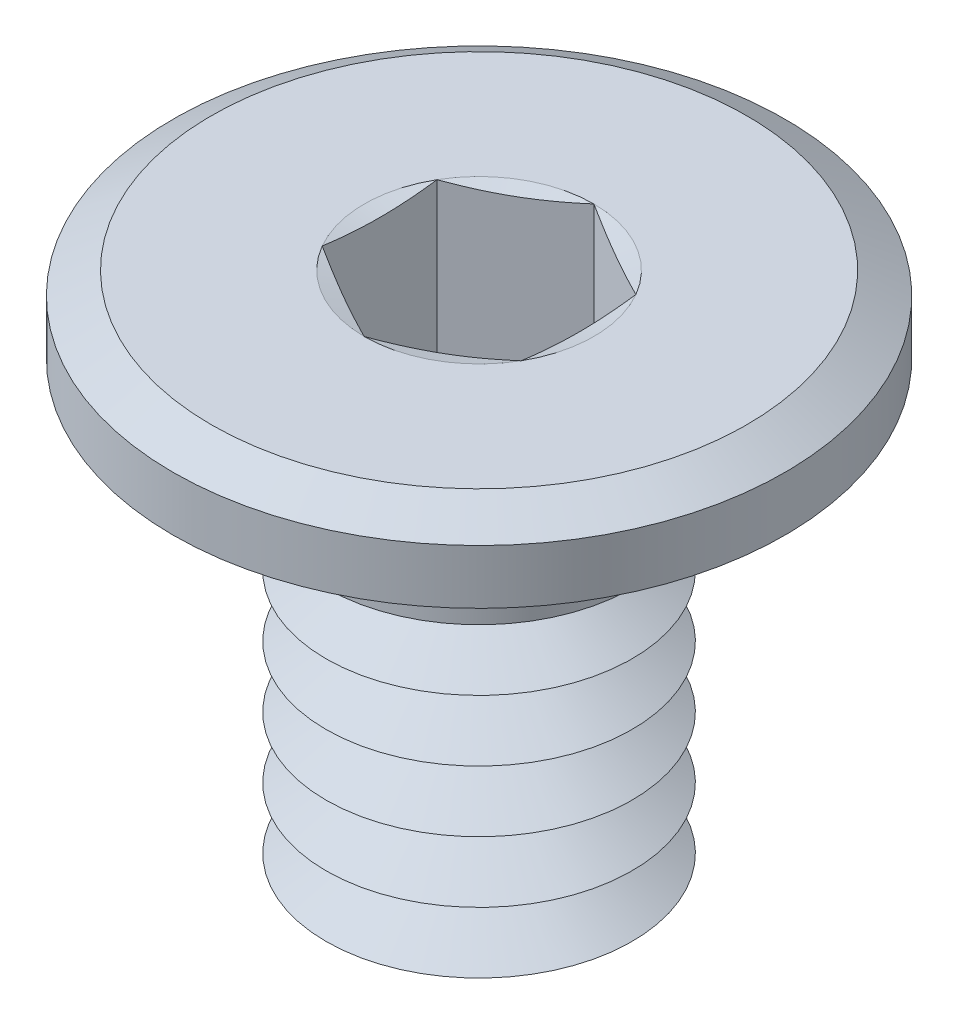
ISO-10303-21;
HEADER;
FILE_DESCRIPTION(('STEP AP214'),'2;1');
FILE_NAME('part.step','',(''),(''),'','','');
FILE_SCHEMA(('AUTOMOTIVE_DESIGN { 1 0 10303 214 1 1 1 1 }'));
ENDSEC;
DATA;
#1=APPLICATION_CONTEXT('core data for automotive mechanical design processes');
#2=APPLICATION_PROTOCOL_DEFINITION('international standard','automotive_design',2000,#1);
#3=PRODUCT_CONTEXT('',#1,'mechanical');
#4=PRODUCT('Part','Part','',(#3));
#5=PRODUCT_RELATED_PRODUCT_CATEGORY('part','',(#4));
#6=PRODUCT_DEFINITION_FORMATION('','',#4);
#7=PRODUCT_DEFINITION_CONTEXT('part definition',#1,'design');
#8=PRODUCT_DEFINITION('design','',#6,#7);
#9=PRODUCT_DEFINITION_SHAPE('','',#8);
#10=(LENGTH_UNIT() NAMED_UNIT(*) SI_UNIT(.MILLI.,.METRE.));
#11=(NAMED_UNIT(*) PLANE_ANGLE_UNIT() SI_UNIT($,.RADIAN.));
#12=(NAMED_UNIT(*) SI_UNIT($,.STERADIAN.) SOLID_ANGLE_UNIT());
#13=UNCERTAINTY_MEASURE_WITH_UNIT(LENGTH_MEASURE(1.E-05),#10,'distance_accuracy_value','');
#14=(GEOMETRIC_REPRESENTATION_CONTEXT(3) GLOBAL_UNCERTAINTY_ASSIGNED_CONTEXT((#13)) GLOBAL_UNIT_ASSIGNED_CONTEXT((#10,
#11,#12)) REPRESENTATION_CONTEXT('',''));
#15=CARTESIAN_POINT('',(0.,0.,0.));
#16=DIRECTION('',(0.,0.,1.));
#17=DIRECTION('',(1.,0.,0.));
#18=AXIS2_PLACEMENT_3D('',#15,#16,#17);
#19=CARTESIAN_POINT('',(0.,-2.9,0.));
#20=DIRECTION('',(0.,-1.,0.));
#21=DIRECTION('',(0.,0.,-1.));
#22=AXIS2_PLACEMENT_3D('',#19,#20,#21);
#23=CONICAL_SURFACE('',#22,1.,1.0471975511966);
#24=CARTESIAN_POINT('',(0.,-2.7,0.));
#25=DIRECTION('',(0.,1.,0.));
#26=DIRECTION('',(0.,0.,1.));
#27=AXIS2_PLACEMENT_3D('',#24,#25,#26);
#28=CIRCLE('',#27,0.653589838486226);
#29=CARTESIAN_POINT('',(0.,-2.7,0.653589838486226));
#30=VERTEX_POINT('',#29);
#31=EDGE_CURVE('E403',#30,#30,#28,.T.);
#32=ORIENTED_EDGE('',*,*,#31,.F.);
#33=EDGE_LOOP('',(#32));
#34=FACE_BOUND('',#33,.T.);
#35=CARTESIAN_POINT('',(0.,-2.9,0.));
#36=DIRECTION('',(0.,1.,0.));
#37=DIRECTION('',(0.,0.,1.));
#38=AXIS2_PLACEMENT_3D('',#35,#36,#37);
#39=CIRCLE('',#38,1.);
#40=CARTESIAN_POINT('',(0.,-2.9,1.));
#41=VERTEX_POINT('',#40);
#42=EDGE_CURVE('E406',#41,#41,#39,.T.);
#43=ORIENTED_EDGE('',*,*,#42,.T.);
#44=EDGE_LOOP('',(#43));
#45=FACE_BOUND('',#44,.T.);
#46=ADVANCED_FACE('F39',(#34,#45),#23,.T.);
#47=CARTESIAN_POINT('',(0.,-2.7,0.));
#48=DIRECTION('',(0.,1.,0.));
#49=DIRECTION('',(0.,0.,1.));
#50=AXIS2_PLACEMENT_3D('',#47,#48,#49);
#51=CONICAL_SURFACE('',#50,0.653589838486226,1.0471975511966);
#52=CARTESIAN_POINT('',(0.,-2.5,0.));
#53=DIRECTION('',(0.,1.,0.));
#54=DIRECTION('',(0.,0.,1.));
#55=AXIS2_PLACEMENT_3D('',#52,#53,#54);
#56=CIRCLE('',#55,1.);
#57=CARTESIAN_POINT('',(0.,-2.5,1.));
#58=VERTEX_POINT('',#57);
#59=EDGE_CURVE('E399',#58,#58,#56,.T.);
#60=ORIENTED_EDGE('',*,*,#59,.F.);
#61=EDGE_LOOP('',(#60));
#62=FACE_BOUND('',#61,.T.);
#63=ORIENTED_EDGE('',*,*,#31,.T.);
#64=EDGE_LOOP('',(#63));
#65=FACE_BOUND('',#64,.T.);
#66=ADVANCED_FACE('F233',(#62,#65),#51,.T.);
#67=CARTESIAN_POINT('',(0.,-3.5,0.));
#68=DIRECTION('',(0.,-1.,0.));
#69=DIRECTION('',(0.,0.,-1.));
#70=AXIS2_PLACEMENT_3D('',#67,#68,#69);
#71=PLANE('',#70);
#72=CARTESIAN_POINT('',(0.,-3.5,0.));
#73=DIRECTION('',(0.,1.,0.));
#74=DIRECTION('',(0.,0.,1.));
#75=AXIS2_PLACEMENT_3D('',#72,#73,#74);
#76=CIRCLE('',#75,0.653589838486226);
#77=CARTESIAN_POINT('',(0.,-3.5,0.653589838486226));
#78=VERTEX_POINT('',#77);
#79=EDGE_CURVE('E299',#78,#78,#76,.T.);
#80=ORIENTED_EDGE('',*,*,#79,.F.);
#81=EDGE_LOOP('',(#80));
#82=FACE_BOUND('',#81,.T.);
#83=ADVANCED_FACE('F239',(#82),#71,.T.);
#84=CARTESIAN_POINT('',(0.,-3.5,0.));
#85=DIRECTION('',(0.,1.,0.));
#86=DIRECTION('',(0.,0.,1.));
#87=AXIS2_PLACEMENT_3D('',#84,#85,#86);
#88=CONICAL_SURFACE('',#87,0.653589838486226,1.0471975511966);
#89=CARTESIAN_POINT('',(0.,-3.3,0.));
#90=DIRECTION('',(0.,1.,0.));
#91=DIRECTION('',(0.,0.,1.));
#92=AXIS2_PLACEMENT_3D('',#89,#90,#91);
#93=CIRCLE('',#92,1.);
#94=CARTESIAN_POINT('',(0.,-3.3,1.));
#95=VERTEX_POINT('',#94);
#96=EDGE_CURVE('E414',#95,#95,#93,.T.);
#97=ORIENTED_EDGE('',*,*,#96,.F.);
#98=EDGE_LOOP('',(#97));
#99=FACE_BOUND('',#98,.T.);
#100=ORIENTED_EDGE('',*,*,#79,.T.);
#101=EDGE_LOOP('',(#100));
#102=FACE_BOUND('',#101,.T.);
#103=ADVANCED_FACE('F254',(#99,#102),#88,.T.);
#104=CARTESIAN_POINT('',(0.,-3.3,0.));
#105=DIRECTION('',(0.,-1.,0.));
#106=DIRECTION('',(0.,0.,-1.));
#107=AXIS2_PLACEMENT_3D('',#104,#105,#106);
#108=CONICAL_SURFACE('',#107,1.,1.0471975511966);
#109=CARTESIAN_POINT('',(0.,-3.1,0.));
#110=DIRECTION('',(0.,1.,0.));
#111=DIRECTION('',(0.,0.,1.));
#112=AXIS2_PLACEMENT_3D('',#109,#110,#111);
#113=CIRCLE('',#112,0.653589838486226);
#114=CARTESIAN_POINT('',(0.,-3.1,0.653589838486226));
#115=VERTEX_POINT('',#114);
#116=EDGE_CURVE('E410',#115,#115,#113,.T.);
#117=ORIENTED_EDGE('',*,*,#116,.F.);
#118=EDGE_LOOP('',(#117));
#119=FACE_BOUND('',#118,.T.);
#120=ORIENTED_EDGE('',*,*,#96,.T.);
#121=EDGE_LOOP('',(#120));
#122=FACE_BOUND('',#121,.T.);
#123=ADVANCED_FACE('F250',(#119,#122),#108,.T.);
#124=CARTESIAN_POINT('',(0.,-3.1,0.));
#125=DIRECTION('',(0.,1.,0.));
#126=DIRECTION('',(0.,0.,1.));
#127=AXIS2_PLACEMENT_3D('',#124,#125,#126);
#128=CONICAL_SURFACE('',#127,0.653589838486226,1.0471975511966);
#129=ORIENTED_EDGE('',*,*,#42,.F.);
#130=EDGE_LOOP('',(#129));
#131=FACE_BOUND('',#130,.T.);
#132=ORIENTED_EDGE('',*,*,#116,.T.);
#133=EDGE_LOOP('',(#132));
#134=FACE_BOUND('',#133,.T.);
#135=ADVANCED_FACE('F246',(#131,#134),#128,.T.);
#136=CARTESIAN_POINT('',(0.,-2.5,0.));
#137=DIRECTION('',(0.,-1.,0.));
#138=DIRECTION('',(0.,0.,-1.));
#139=AXIS2_PLACEMENT_3D('',#136,#137,#138);
#140=CONICAL_SURFACE('',#139,1.,1.0471975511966);
#141=CARTESIAN_POINT('',(0.,-2.3,0.));
#142=DIRECTION('',(0.,1.,0.));
#143=DIRECTION('',(0.,0.,1.));
#144=AXIS2_PLACEMENT_3D('',#141,#142,#143);
#145=CIRCLE('',#144,0.653589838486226);
#146=CARTESIAN_POINT('',(0.,-2.3,0.653589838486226));
#147=VERTEX_POINT('',#146);
#148=EDGE_CURVE('E396',#147,#147,#145,.T.);
#149=ORIENTED_EDGE('',*,*,#148,.F.);
#150=EDGE_LOOP('',(#149));
#151=FACE_BOUND('',#150,.T.);
#152=ORIENTED_EDGE('',*,*,#59,.T.);
#153=EDGE_LOOP('',(#152));
#154=FACE_BOUND('',#153,.T.);
#155=ADVANCED_FACE('F249',(#151,#154),#140,.T.);
#156=CARTESIAN_POINT('',(0.,-2.3,0.));
#157=DIRECTION('',(0.,1.,0.));
#158=DIRECTION('',(0.,0.,1.));
#159=AXIS2_PLACEMENT_3D('',#156,#157,#158);
#160=CONICAL_SURFACE('',#159,0.653589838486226,1.0471975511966);
#161=CARTESIAN_POINT('',(0.,-2.1,0.));
#162=DIRECTION('',(0.,1.,0.));
#163=DIRECTION('',(0.,0.,1.));
#164=AXIS2_PLACEMENT_3D('',#161,#162,#163);
#165=CIRCLE('',#164,1.);
#166=CARTESIAN_POINT('',(0.,-2.1,1.));
#167=VERTEX_POINT('',#166);
#168=EDGE_CURVE('E393',#167,#167,#165,.T.);
#169=ORIENTED_EDGE('',*,*,#168,.F.);
#170=EDGE_LOOP('',(#169));
#171=FACE_BOUND('',#170,.T.);
#172=ORIENTED_EDGE('',*,*,#148,.T.);
#173=EDGE_LOOP('',(#172));
#174=FACE_BOUND('',#173,.T.);
#175=ADVANCED_FACE('F490',(#171,#174),#160,.T.);
#176=CARTESIAN_POINT('',(0.,-2.1,0.));
#177=DIRECTION('',(0.,-1.,0.));
#178=DIRECTION('',(0.,0.,-1.));
#179=AXIS2_PLACEMENT_3D('',#176,#177,#178);
#180=CONICAL_SURFACE('',#179,1.,1.0471975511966);
#181=CARTESIAN_POINT('',(0.,-1.9,0.));
#182=DIRECTION('',(0.,1.,0.));
#183=DIRECTION('',(0.,0.,1.));
#184=AXIS2_PLACEMENT_3D('',#181,#182,#183);
#185=CIRCLE('',#184,0.653589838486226);
#186=CARTESIAN_POINT('',(0.,-1.9,0.653589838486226));
#187=VERTEX_POINT('',#186);
#188=EDGE_CURVE('E389',#187,#187,#185,.T.);
#189=ORIENTED_EDGE('',*,*,#188,.F.);
#190=EDGE_LOOP('',(#189));
#191=FACE_BOUND('',#190,.T.);
#192=ORIENTED_EDGE('',*,*,#168,.T.);
#193=EDGE_LOOP('',(#192));
#194=FACE_BOUND('',#193,.T.);
#195=ADVANCED_FACE('F486',(#191,#194),#180,.T.);
#196=CARTESIAN_POINT('',(0.,-1.9,0.));
#197=DIRECTION('',(0.,1.,0.));
#198=DIRECTION('',(0.,0.,1.));
#199=AXIS2_PLACEMENT_3D('',#196,#197,#198);
#200=CONICAL_SURFACE('',#199,0.653589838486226,1.0471975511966);
#201=CARTESIAN_POINT('',(0.,-1.7,0.));
#202=DIRECTION('',(0.,1.,0.));
#203=DIRECTION('',(0.,0.,1.));
#204=AXIS2_PLACEMENT_3D('',#201,#202,#203);
#205=CIRCLE('',#204,1.);
#206=CARTESIAN_POINT('',(0.,-1.7,1.));
#207=VERTEX_POINT('',#206);
#208=EDGE_CURVE('E385',#207,#207,#205,.T.);
#209=ORIENTED_EDGE('',*,*,#208,.F.);
#210=EDGE_LOOP('',(#209));
#211=FACE_BOUND('',#210,.T.);
#212=ORIENTED_EDGE('',*,*,#188,.T.);
#213=EDGE_LOOP('',(#212));
#214=FACE_BOUND('',#213,.T.);
#215=ADVANCED_FACE('F482',(#211,#214),#200,.T.);
#216=CARTESIAN_POINT('',(0.,-1.7,0.));
#217=DIRECTION('',(0.,-1.,0.));
#218=DIRECTION('',(0.,0.,-1.));
#219=AXIS2_PLACEMENT_3D('',#216,#217,#218);
#220=CONICAL_SURFACE('',#219,1.,1.0471975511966);
#221=CARTESIAN_POINT('',(0.,-1.5,0.));
#222=DIRECTION('',(0.,1.,0.));
#223=DIRECTION('',(0.,0.,1.));
#224=AXIS2_PLACEMENT_3D('',#221,#222,#223);
#225=CIRCLE('',#224,0.653589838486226);
#226=CARTESIAN_POINT('',(0.,-1.5,0.653589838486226));
#227=VERTEX_POINT('',#226);
#228=EDGE_CURVE('E382',#227,#227,#225,.T.);
#229=ORIENTED_EDGE('',*,*,#228,.F.);
#230=EDGE_LOOP('',(#229));
#231=FACE_BOUND('',#230,.T.);
#232=ORIENTED_EDGE('',*,*,#208,.T.);
#233=EDGE_LOOP('',(#232));
#234=FACE_BOUND('',#233,.T.);
#235=ADVANCED_FACE('F478',(#231,#234),#220,.T.);
#236=CARTESIAN_POINT('',(0.,-1.5,0.));
#237=DIRECTION('',(0.,1.,0.));
#238=DIRECTION('',(0.,0.,1.));
#239=AXIS2_PLACEMENT_3D('',#236,#237,#238);
#240=CONICAL_SURFACE('',#239,0.653589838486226,1.0471975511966);
#241=CARTESIAN_POINT('',(0.,-1.3,0.));
#242=DIRECTION('',(0.,1.,0.));
#243=DIRECTION('',(0.,0.,1.));
#244=AXIS2_PLACEMENT_3D('',#241,#242,#243);
#245=CIRCLE('',#244,1.);
#246=CARTESIAN_POINT('',(0.,-1.3,1.));
#247=VERTEX_POINT('',#246);
#248=EDGE_CURVE('E366',#247,#247,#245,.T.);
#249=ORIENTED_EDGE('',*,*,#248,.F.);
#250=EDGE_LOOP('',(#249));
#251=FACE_BOUND('',#250,.T.);
#252=ORIENTED_EDGE('',*,*,#228,.T.);
#253=EDGE_LOOP('',(#252));
#254=FACE_BOUND('',#253,.T.);
#255=ADVANCED_FACE('F274',(#251,#254),#240,.T.);
#256=CARTESIAN_POINT('',(0.,0.,0.));
#257=DIRECTION('',(0.,1.,0.));
#258=DIRECTION('',(0.,0.,1.));
#259=AXIS2_PLACEMENT_3D('',#256,#257,#258);
#260=PLANE('',#259);
#261=CARTESIAN_POINT('',(0.,0.,0.));
#262=DIRECTION('',(0.,1.,0.));
#263=DIRECTION('',(0.,0.,1.));
#264=AXIS2_PLACEMENT_3D('',#261,#262,#263);
#265=CIRCLE('',#264,0.750555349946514);
#266=CARTESIAN_POINT('',(0.,0.,0.750555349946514));
#267=VERTEX_POINT('',#266);
#268=CARTESIAN_POINT('',(0.65,0.,0.375277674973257));
#269=VERTEX_POINT('',#268);
#270=EDGE_CURVE('E66',#267,#269,#265,.T.);
#271=ORIENTED_EDGE('',*,*,#270,.F.);
#272=CARTESIAN_POINT('',(-0.65,0.,0.375277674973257));
#273=VERTEX_POINT('',#272);
#274=EDGE_CURVE('E169',#273,#267,#265,.T.);
#275=ORIENTED_EDGE('',*,*,#274,.F.);
#276=CARTESIAN_POINT('',(-0.65,0.,-0.375277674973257));
#277=VERTEX_POINT('',#276);
#278=EDGE_CURVE('E164',#277,#273,#265,.T.);
#279=ORIENTED_EDGE('',*,*,#278,.F.);
#280=CARTESIAN_POINT('',(0.,0.,-0.750555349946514));
#281=VERTEX_POINT('',#280);
#282=EDGE_CURVE('E128',#281,#277,#265,.T.);
#283=ORIENTED_EDGE('',*,*,#282,.F.);
#284=CARTESIAN_POINT('',(0.65,0.,-0.375277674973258));
#285=VERTEX_POINT('',#284);
#286=EDGE_CURVE('E119',#285,#281,#265,.T.);
#287=ORIENTED_EDGE('',*,*,#286,.F.);
#288=EDGE_CURVE('E59',#269,#285,#265,.T.);
#289=ORIENTED_EDGE('',*,*,#288,.F.);
#290=EDGE_LOOP('',(#271,#275,#279,#283,#287,#289));
#291=FACE_BOUND('',#290,.T.);
#292=CARTESIAN_POINT('',(0.,0.,0.));
#293=DIRECTION('',(0.,1.,0.));
#294=DIRECTION('',(0.,0.,1.));
#295=AXIS2_PLACEMENT_3D('',#292,#293,#294);
#296=CIRCLE('',#295,1.75);
#297=CARTESIAN_POINT('',(0.,0.,1.75));
#298=VERTEX_POINT('',#297);
#299=EDGE_CURVE('E295',#298,#298,#296,.T.);
#300=ORIENTED_EDGE('',*,*,#299,.T.);
#301=EDGE_LOOP('',(#300));
#302=FACE_BOUND('',#301,.T.);
#303=ADVANCED_FACE('F160',(#291,#302),#260,.T.);
#304=CARTESIAN_POINT('',(0.,-0.5,0.));
#305=DIRECTION('',(0.,1.,0.));
#306=DIRECTION('',(0.,0.,1.));
#307=AXIS2_PLACEMENT_3D('',#304,#305,#306);
#308=CYLINDRICAL_SURFACE('',#307,2.);
#309=CARTESIAN_POINT('',(0.,-0.144337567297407,0.));
#310=DIRECTION('',(0.,1.,0.));
#311=DIRECTION('',(0.,0.,1.));
#312=AXIS2_PLACEMENT_3D('',#309,#310,#311);
#313=CIRCLE('',#312,2.);
#314=CARTESIAN_POINT('',(0.,-0.144337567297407,2.));
#315=VERTEX_POINT('',#314);
#316=EDGE_CURVE('E306',#315,#315,#313,.F.);
#317=ORIENTED_EDGE('',*,*,#316,.T.);
#318=EDGE_LOOP('',(#317));
#319=FACE_BOUND('',#318,.T.);
#320=CARTESIAN_POINT('',(0.,-0.5,0.));
#321=DIRECTION('',(0.,1.,0.));
#322=DIRECTION('',(0.,0.,1.));
#323=AXIS2_PLACEMENT_3D('',#320,#321,#322);
#324=CIRCLE('',#323,2.);
#325=CARTESIAN_POINT('',(0.,-0.5,2.));
#326=VERTEX_POINT('',#325);
#327=EDGE_CURVE('E291',#326,#326,#324,.T.);
#328=ORIENTED_EDGE('',*,*,#327,.T.);
#329=EDGE_LOOP('',(#328));
#330=FACE_BOUND('',#329,.T.);
#331=ADVANCED_FACE('F270',(#319,#330),#308,.T.);
#332=CARTESIAN_POINT('',(0.,-0.5,0.));
#333=DIRECTION('',(0.,1.,0.));
#334=DIRECTION('',(0.,0.,1.));
#335=AXIS2_PLACEMENT_3D('',#332,#333,#334);
#336=PLANE('',#335);
#337=CARTESIAN_POINT('',(0.,-0.5,0.));
#338=DIRECTION('',(0.,1.,0.));
#339=DIRECTION('',(0.,0.,1.));
#340=AXIS2_PLACEMENT_3D('',#337,#338,#339);
#341=CIRCLE('',#340,1.1);
#342=CARTESIAN_POINT('',(0.,-0.5,1.1));
#343=VERTEX_POINT('',#342);
#344=EDGE_CURVE('E286',#343,#343,#341,.T.);
#345=ORIENTED_EDGE('',*,*,#344,.T.);
#346=EDGE_LOOP('',(#345));
#347=FACE_BOUND('',#346,.T.);
#348=ORIENTED_EDGE('',*,*,#327,.F.);
#349=EDGE_LOOP('',(#348));
#350=FACE_BOUND('',#349,.T.);
#351=ADVANCED_FACE('F266',(#347,#350),#336,.F.);
#352=CARTESIAN_POINT('',(0.,-3.5,0.));
#353=DIRECTION('',(0.,1.,0.));
#354=DIRECTION('',(0.,0.,1.));
#355=AXIS2_PLACEMENT_3D('',#352,#353,#354);
#356=CYLINDRICAL_SURFACE('',#355,1.);
#357=CARTESIAN_POINT('',(0.,-0.6,0.));
#358=DIRECTION('',(0.,1.,0.));
#359=DIRECTION('',(0.,0.,1.));
#360=AXIS2_PLACEMENT_3D('',#357,#358,#359);
#361=CIRCLE('',#360,1.);
#362=CARTESIAN_POINT('',(0.,-0.6,1.));
#363=VERTEX_POINT('',#362);
#364=EDGE_CURVE('E289',#363,#363,#361,.F.);
#365=ORIENTED_EDGE('',*,*,#364,.T.);
#366=EDGE_LOOP('',(#365));
#367=FACE_BOUND('',#366,.T.);
#368=ORIENTED_EDGE('',*,*,#248,.T.);
#369=EDGE_LOOP('',(#368));
#370=FACE_BOUND('',#369,.T.);
#371=ADVANCED_FACE('F262',(#367,#370),#356,.T.);
#372=CARTESIAN_POINT('',(0.,-0.6,0.));
#373=DIRECTION('',(0.,1.,0.));
#374=DIRECTION('',(0.,0.,1.));
#375=AXIS2_PLACEMENT_3D('',#372,#373,#374);
#376=TOROIDAL_SURFACE('',#375,1.1,0.1);
#377=ORIENTED_EDGE('',*,*,#344,.F.);
#378=EDGE_LOOP('',(#377));
#379=FACE_BOUND('',#378,.T.);
#380=ORIENTED_EDGE('',*,*,#364,.F.);
#381=EDGE_LOOP('',(#380));
#382=FACE_BOUND('',#381,.T.);
#383=ADVANCED_FACE('F265',(#379,#382),#376,.F.);
#384=CARTESIAN_POINT('',(0.,0.,0.));
#385=DIRECTION('',(0.,-1.,0.));
#386=DIRECTION('',(0.,0.,-1.));
#387=AXIS2_PLACEMENT_3D('',#384,#385,#386);
#388=CONICAL_SURFACE('',#387,1.75,1.0471975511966);
#389=ORIENTED_EDGE('',*,*,#316,.F.);
#390=EDGE_LOOP('',(#389));
#391=FACE_BOUND('',#390,.T.);
#392=ORIENTED_EDGE('',*,*,#299,.F.);
#393=EDGE_LOOP('',(#392));
#394=FACE_BOUND('',#393,.T.);
#395=ADVANCED_FACE('F41',(#391,#394),#388,.T.);
#396=CARTESIAN_POINT('',(0.,0.,0.));
#397=DIRECTION('',(0.,1.,0.));
#398=DIRECTION('',(0.,0.,1.));
#399=AXIS2_PLACEMENT_3D('',#396,#397,#398);
#400=CONICAL_SURFACE('',#399,0.750555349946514,1.30899693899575);
#401=ORIENTED_EDGE('',*,*,#282,.T.);
#402=CARTESIAN_POINT('',(0.000200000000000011,3.09472466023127E-05,-0.750670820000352));
#403=CARTESIAN_POINT('',(-0.0268094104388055,-0.00415092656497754,-0.735076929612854));
#404=CARTESIAN_POINT('',(-0.0538678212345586,-0.00794750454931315,-0.719454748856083));
#405=CARTESIAN_POINT('',(-0.108080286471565,-0.0146178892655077,-0.688155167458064));
#406=CARTESIAN_POINT('',(-0.135234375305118,-0.0174913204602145,-0.672477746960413));
#407=CARTESIAN_POINT('',(-0.18947340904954,-0.0221475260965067,-0.641162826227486));
#408=CARTESIAN_POINT('',(-0.216557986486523,-0.0239358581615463,-0.625525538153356));
#409=CARTESIAN_POINT('',(-0.270761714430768,-0.0263338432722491,-0.594231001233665));
#410=CARTESIAN_POINT('',(-0.297880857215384,-0.0269437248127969,-0.578573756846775));
#411=CARTESIAN_POINT('',(-0.352119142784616,-0.0269437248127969,-0.547259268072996));
#412=CARTESIAN_POINT('',(-0.379238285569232,-0.0263338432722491,-0.531602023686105));
#413=CARTESIAN_POINT('',(-0.433442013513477,-0.0239358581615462,-0.500307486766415));
#414=CARTESIAN_POINT('',(-0.460526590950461,-0.0221475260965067,-0.484670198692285));
#415=CARTESIAN_POINT('',(-0.514765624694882,-0.0174913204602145,-0.453355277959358));
#416=CARTESIAN_POINT('',(-0.541919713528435,-0.0146178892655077,-0.437677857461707));
#417=CARTESIAN_POINT('',(-0.596132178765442,-0.00794750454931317,-0.406378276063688));
#418=CARTESIAN_POINT('',(-0.623190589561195,-0.00415092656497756,-0.390756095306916));
#419=CARTESIAN_POINT('',(-0.6502,3.09472466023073E-05,-0.375162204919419));
#420=B_SPLINE_CURVE_WITH_KNOTS('',3,(#402,#403,#404,#405,#406,#407,#408,#409,#410,#411,#412,
#413,#414,#415,#416,#417,#418,#419),.UNSPECIFIED.,.F.,.F.,(4,2,2,2,2,2,2,2,4),(0.,
0.0944056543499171,0.188849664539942,0.282805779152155,0.376743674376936,0.470681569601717,
0.564637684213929,0.659081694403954,0.753487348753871),.UNSPECIFIED.);
#421=EDGE_CURVE('E11',#281,#277,#420,.T.);
#422=ORIENTED_EDGE('',*,*,#421,.F.);
#423=EDGE_LOOP('',(#401,#422));
#424=FACE_BOUND('',#423,.T.);
#425=ADVANCED_FACE('F132',(#424),#400,.F.);
#426=ORIENTED_EDGE('',*,*,#278,.T.);
#427=CARTESIAN_POINT('',(-0.65,0.153431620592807,-1.15250975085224));
#428=CARTESIAN_POINT('',(-0.65,0.140485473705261,-1.09696292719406));
#429=CARTESIAN_POINT('',(-0.65,0.12772104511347,-1.04137089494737));
#430=CARTESIAN_POINT('',(-0.65,0.102806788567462,-0.93003898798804));
#431=CARTESIAN_POINT('',(-0.65,0.0906570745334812,-0.874299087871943));
#432=CARTESIAN_POINT('',(-0.65,0.0671143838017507,-0.762091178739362));
#433=CARTESIAN_POINT('',(-0.65,0.0557299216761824,-0.70562136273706));
#434=CARTESIAN_POINT('',(-0.65,0.0342960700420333,-0.59241870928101));
#435=CARTESIAN_POINT('',(-0.65,0.0242468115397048,-0.535685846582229));
#436=CARTESIAN_POINT('',(-0.65,0.00641278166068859,-0.423455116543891));
#437=CARTESIAN_POINT('',(-0.65,-0.00142665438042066,-0.367966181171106));
#438=CARTESIAN_POINT('',(-0.65,-0.0143371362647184,-0.256669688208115));
#439=CARTESIAN_POINT('',(-0.65,-0.0194090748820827,-0.200862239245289));
#440=CARTESIAN_POINT('',(-0.65,-0.025908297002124,-0.0892782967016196));
#441=CARTESIAN_POINT('',(-0.65,-0.0273521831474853,-0.0335028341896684));
#442=CARTESIAN_POINT('',(-0.65,-0.0263311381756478,0.078014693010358));
#443=CARTESIAN_POINT('',(-0.65,-0.0238659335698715,0.133756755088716));
#444=CARTESIAN_POINT('',(-0.65,-0.016691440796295,0.229596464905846));
#445=CARTESIAN_POINT('',(-0.65,-0.0127907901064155,0.269759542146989));
#446=CARTESIAN_POINT('',(-0.65,-0.00354681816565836,0.349915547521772));
#447=CARTESIAN_POINT('',(-0.65,0.00179646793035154,0.389908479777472));
#448=CARTESIAN_POINT('',(-0.65,0.0195190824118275,0.50990254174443));
#449=CARTESIAN_POINT('',(-0.65,0.0335668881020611,0.589653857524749));
#450=CARTESIAN_POINT('',(-0.65,0.0566589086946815,0.709742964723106));
#451=CARTESIAN_POINT('',(-0.65,0.0647873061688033,0.750268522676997));
#452=CARTESIAN_POINT('',(-0.65,0.0815416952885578,0.831218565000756));
#453=CARTESIAN_POINT('',(-0.65,0.0901676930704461,0.871643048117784));
#454=CARTESIAN_POINT('',(-0.65,0.107740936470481,0.952178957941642));
#455=CARTESIAN_POINT('',(-0.65,0.116686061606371,0.992290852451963));
#456=CARTESIAN_POINT('',(-0.65,0.134863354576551,1.07244661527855));
#457=CARTESIAN_POINT('',(-0.65,0.144095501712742,1.11249048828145));
#458=CARTESIAN_POINT('',(-0.65,0.153431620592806,1.15250975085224));
#459=B_SPLINE_CURVE_WITH_KNOTS('',3,(#427,#428,#429,#430,#431,#432,#433,#434,#435,#436,#437,
#438,#439,#440,#441,#442,#443,#444,#445,#446,#447,#448,#449,#450,#451,#452,#453,#454,#455,#456,
#457,#458),.UNSPECIFIED.,.F.,.F.,(4,2,2,2,2,2,2,2,2,2,2,2,2,2,2,4),(0.,0.171110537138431,
0.342252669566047,0.515060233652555,0.687884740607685,0.855957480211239,1.02397596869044,
1.19122416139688,1.3584840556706,1.4795115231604,1.60053604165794,1.84338230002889,
1.9673809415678,2.09138111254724,2.21467179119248,2.33795359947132),.UNSPECIFIED.);
#460=EDGE_CURVE('E172',#277,#273,#459,.T.);
#461=ORIENTED_EDGE('',*,*,#460,.F.);
#462=EDGE_LOOP('',(#426,#461));
#463=FACE_BOUND('',#462,.T.);
#464=ADVANCED_FACE('F548',(#463),#400,.F.);
#465=ORIENTED_EDGE('',*,*,#274,.T.);
#466=CARTESIAN_POINT('',(-0.6502,3.09472466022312E-05,0.375162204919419));
#467=CARTESIAN_POINT('',(-0.623190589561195,-0.0041509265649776,0.390756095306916));
#468=CARTESIAN_POINT('',(-0.596132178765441,-0.00794750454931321,0.406378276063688));
#469=CARTESIAN_POINT('',(-0.541919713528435,-0.0146178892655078,0.437677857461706));
#470=CARTESIAN_POINT('',(-0.514765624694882,-0.0174913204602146,0.453355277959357));
#471=CARTESIAN_POINT('',(-0.460526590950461,-0.0221475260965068,0.484670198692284));
#472=CARTESIAN_POINT('',(-0.433442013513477,-0.0239358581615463,0.500307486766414));
#473=CARTESIAN_POINT('',(-0.379238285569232,-0.0263338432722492,0.531602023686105));
#474=CARTESIAN_POINT('',(-0.352119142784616,-0.026943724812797,0.547259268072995));
#475=CARTESIAN_POINT('',(-0.297880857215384,-0.026943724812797,0.578573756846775));
#476=CARTESIAN_POINT('',(-0.270761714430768,-0.0263338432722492,0.594231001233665));
#477=CARTESIAN_POINT('',(-0.216557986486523,-0.0239358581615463,0.625525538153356));
#478=CARTESIAN_POINT('',(-0.18947340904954,-0.0221475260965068,0.641162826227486));
#479=CARTESIAN_POINT('',(-0.135234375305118,-0.0174913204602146,0.672477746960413));
#480=CARTESIAN_POINT('',(-0.108080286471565,-0.0146178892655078,0.688155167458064));
#481=CARTESIAN_POINT('',(-0.0538678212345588,-0.00794750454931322,0.719454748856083));
#482=CARTESIAN_POINT('',(-0.0268094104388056,-0.0041509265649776,0.735076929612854));
#483=CARTESIAN_POINT('',(0.000199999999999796,3.09472466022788E-05,0.750670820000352));
#484=B_SPLINE_CURVE_WITH_KNOTS('',3,(#466,#467,#468,#469,#470,#471,#472,#473,#474,#475,#476,
#477,#478,#479,#480,#481,#482,#483),.UNSPECIFIED.,.F.,.F.,(4,2,2,2,2,2,2,2,4),(0.,
0.0944056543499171,0.188849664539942,0.282805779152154,0.376743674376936,0.470681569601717,
0.564637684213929,0.659081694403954,0.753487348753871),.UNSPECIFIED.);
#485=EDGE_CURVE('E180',#273,#267,#484,.T.);
#486=ORIENTED_EDGE('',*,*,#485,.F.);
#487=EDGE_LOOP('',(#465,#486));
#488=FACE_BOUND('',#487,.T.);
#489=ADVANCED_FACE('F446',(#488),#400,.F.);
#490=ORIENTED_EDGE('',*,*,#270,.T.);
#491=CARTESIAN_POINT('',(-0.000200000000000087,3.09472466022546E-05,0.750670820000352));
#492=CARTESIAN_POINT('',(0.0268094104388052,-0.00415092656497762,0.735076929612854));
#493=CARTESIAN_POINT('',(0.0538678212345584,-0.00794750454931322,0.719454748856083));
#494=CARTESIAN_POINT('',(0.108080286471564,-0.0146178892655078,0.688155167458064));
#495=CARTESIAN_POINT('',(0.135234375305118,-0.0174913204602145,0.672477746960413));
#496=CARTESIAN_POINT('',(0.189473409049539,-0.0221475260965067,0.641162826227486));
#497=CARTESIAN_POINT('',(0.216557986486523,-0.0239358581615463,0.625525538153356));
#498=CARTESIAN_POINT('',(0.270761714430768,-0.0263338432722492,0.594231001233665));
#499=CARTESIAN_POINT('',(0.297880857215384,-0.0269437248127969,0.578573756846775));
#500=CARTESIAN_POINT('',(0.352119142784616,-0.0269437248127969,0.547259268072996));
#501=CARTESIAN_POINT('',(0.379238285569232,-0.0263338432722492,0.531602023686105));
#502=CARTESIAN_POINT('',(0.433442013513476,-0.0239358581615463,0.500307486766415));
#503=CARTESIAN_POINT('',(0.46052659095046,-0.0221475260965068,0.484670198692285));
#504=CARTESIAN_POINT('',(0.514765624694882,-0.0174913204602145,0.453355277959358));
#505=CARTESIAN_POINT('',(0.541919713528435,-0.0146178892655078,0.437677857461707));
#506=CARTESIAN_POINT('',(0.596132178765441,-0.00794750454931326,0.406378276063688));
#507=CARTESIAN_POINT('',(0.623190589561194,-0.00415092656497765,0.390756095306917));
#508=CARTESIAN_POINT('',(0.6502,3.09472466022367E-05,0.375162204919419));
#509=B_SPLINE_CURVE_WITH_KNOTS('',3,(#491,#492,#493,#494,#495,#496,#497,#498,#499,#500,#501,
#502,#503,#504,#505,#506,#507,#508),.UNSPECIFIED.,.F.,.F.,(4,2,2,2,2,2,2,2,4),(0.,
0.0944056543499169,0.188849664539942,0.282805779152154,0.376743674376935,0.470681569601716,
0.564637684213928,0.659081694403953,0.753487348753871),.UNSPECIFIED.);
#510=EDGE_CURVE('E199',#267,#269,#509,.T.);
#511=ORIENTED_EDGE('',*,*,#510,.F.);
#512=EDGE_LOOP('',(#490,#511));
#513=FACE_BOUND('',#512,.T.);
#514=ADVANCED_FACE('F447',(#513),#400,.F.);
#515=ORIENTED_EDGE('',*,*,#288,.T.);
#516=CARTESIAN_POINT('',(0.65,0.153431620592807,1.15250975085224));
#517=CARTESIAN_POINT('',(0.65,0.140485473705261,1.09696292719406));
#518=CARTESIAN_POINT('',(0.65,0.12772104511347,1.04137089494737));
#519=CARTESIAN_POINT('',(0.65,0.102806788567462,0.93003898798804));
#520=CARTESIAN_POINT('',(0.65,0.0906570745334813,0.874299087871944));
#521=CARTESIAN_POINT('',(0.65,0.0671143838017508,0.762091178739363));
#522=CARTESIAN_POINT('',(0.65,0.0557299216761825,0.705621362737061));
#523=CARTESIAN_POINT('',(0.65,0.0342960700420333,0.592418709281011));
#524=CARTESIAN_POINT('',(0.65,0.0242468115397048,0.53568584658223));
#525=CARTESIAN_POINT('',(0.65,0.00641278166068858,0.423455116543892));
#526=CARTESIAN_POINT('',(0.65,-0.00142665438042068,0.367966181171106));
#527=CARTESIAN_POINT('',(0.65,-0.0143371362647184,0.256669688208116));
#528=CARTESIAN_POINT('',(0.65,-0.0194090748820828,0.200862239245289));
#529=CARTESIAN_POINT('',(0.65,-0.0259082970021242,0.08927829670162));
#530=CARTESIAN_POINT('',(0.65,-0.0273521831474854,0.0335028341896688));
#531=CARTESIAN_POINT('',(0.65,-0.0263311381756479,-0.0780146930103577));
#532=CARTESIAN_POINT('',(0.65,-0.0238659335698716,-0.133756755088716));
#533=CARTESIAN_POINT('',(0.65,-0.0166914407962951,-0.229596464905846));
#534=CARTESIAN_POINT('',(0.65,-0.0127907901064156,-0.269759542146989));
#535=CARTESIAN_POINT('',(0.65,-0.00354681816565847,-0.349915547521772));
#536=CARTESIAN_POINT('',(0.65,0.00179646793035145,-0.389908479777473));
#537=CARTESIAN_POINT('',(0.65,0.0195190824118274,-0.509902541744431));
#538=CARTESIAN_POINT('',(0.649999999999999,0.033566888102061,-0.589653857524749));
#539=CARTESIAN_POINT('',(0.649999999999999,0.0566589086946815,-0.709742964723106));
#540=CARTESIAN_POINT('',(0.649999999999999,0.0647873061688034,-0.750268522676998));
#541=CARTESIAN_POINT('',(0.649999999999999,0.081541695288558,-0.831218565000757));
#542=CARTESIAN_POINT('',(0.649999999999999,0.0901676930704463,-0.871643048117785));
#543=CARTESIAN_POINT('',(0.649999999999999,0.107740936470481,-0.952178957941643));
#544=CARTESIAN_POINT('',(0.649999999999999,0.116686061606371,-0.992290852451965));
#545=CARTESIAN_POINT('',(0.649999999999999,0.134863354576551,-1.07244661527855));
#546=CARTESIAN_POINT('',(0.649999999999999,0.144095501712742,-1.11249048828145));
#547=CARTESIAN_POINT('',(0.649999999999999,0.153431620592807,-1.15250975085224));
#548=B_SPLINE_CURVE_WITH_KNOTS('',3,(#516,#517,#518,#519,#520,#521,#522,#523,#524,#525,#526,
#527,#528,#529,#530,#531,#532,#533,#534,#535,#536,#537,#538,#539,#540,#541,#542,#543,#544,#545,
#546,#547),.UNSPECIFIED.,.F.,.F.,(4,2,2,2,2,2,2,2,2,2,2,2,2,2,2,4),(0.,0.171110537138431,
0.342252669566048,0.515060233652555,0.687884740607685,0.855957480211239,1.02397596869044,
1.19122416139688,1.3584840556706,1.47951152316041,1.60053604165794,1.84338230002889,
1.9673809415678,2.09138111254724,2.21467179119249,2.33795359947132),.UNSPECIFIED.);
#549=EDGE_CURVE('E149',#269,#285,#548,.T.);
#550=ORIENTED_EDGE('',*,*,#549,.F.);
#551=EDGE_LOOP('',(#515,#550));
#552=FACE_BOUND('',#551,.T.);
#553=ADVANCED_FACE('F192',(#552),#400,.F.);
#554=ORIENTED_EDGE('',*,*,#286,.T.);
#555=CARTESIAN_POINT('',(0.6502,3.09472466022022E-05,-0.375162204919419));
#556=CARTESIAN_POINT('',(0.623190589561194,-0.00415092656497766,-0.390756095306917));
#557=CARTESIAN_POINT('',(0.596132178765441,-0.00794750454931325,-0.406378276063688));
#558=CARTESIAN_POINT('',(0.541919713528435,-0.0146178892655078,-0.437677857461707));
#559=CARTESIAN_POINT('',(0.514765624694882,-0.0174913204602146,-0.453355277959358));
#560=CARTESIAN_POINT('',(0.46052659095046,-0.0221475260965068,-0.484670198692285));
#561=CARTESIAN_POINT('',(0.433442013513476,-0.0239358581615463,-0.500307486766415));
#562=CARTESIAN_POINT('',(0.379238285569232,-0.0263338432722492,-0.531602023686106));
#563=CARTESIAN_POINT('',(0.352119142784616,-0.0269437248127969,-0.547259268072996));
#564=CARTESIAN_POINT('',(0.297880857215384,-0.0269437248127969,-0.578573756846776));
#565=CARTESIAN_POINT('',(0.270761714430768,-0.0263338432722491,-0.594231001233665));
#566=CARTESIAN_POINT('',(0.216557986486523,-0.0239358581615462,-0.625525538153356));
#567=CARTESIAN_POINT('',(0.189473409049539,-0.0221475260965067,-0.641162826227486));
#568=CARTESIAN_POINT('',(0.135234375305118,-0.0174913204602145,-0.672477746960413));
#569=CARTESIAN_POINT('',(0.108080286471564,-0.0146178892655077,-0.688155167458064));
#570=CARTESIAN_POINT('',(0.0538678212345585,-0.00794750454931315,-0.719454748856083));
#571=CARTESIAN_POINT('',(0.0268094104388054,-0.00415092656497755,-0.735076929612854));
#572=CARTESIAN_POINT('',(-0.000200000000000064,3.09472466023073E-05,-0.750670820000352));
#573=B_SPLINE_CURVE_WITH_KNOTS('',3,(#555,#556,#557,#558,#559,#560,#561,#562,#563,#564,#565,
#566,#567,#568,#569,#570,#571,#572),.UNSPECIFIED.,.F.,.F.,(4,2,2,2,2,2,2,2,4),(0.,
0.0944056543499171,0.188849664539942,0.282805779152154,0.376743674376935,0.470681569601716,
0.564637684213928,0.659081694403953,0.75348734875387),.UNSPECIFIED.);
#574=EDGE_CURVE('E123',#285,#281,#573,.T.);
#575=ORIENTED_EDGE('',*,*,#574,.F.);
#576=EDGE_LOOP('',(#554,#575));
#577=FACE_BOUND('',#576,.T.);
#578=ADVANCED_FACE('F121',(#577),#400,.F.);
#579=CARTESIAN_POINT('',(0.,-1.2,0.));
#580=DIRECTION('',(0.,1.,0.));
#581=DIRECTION('',(0.,0.,1.));
#582=AXIS2_PLACEMENT_3D('',#579,#580,#581);
#583=CONICAL_SURFACE('',#582,0.65,1.0471975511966);
#584=CARTESIAN_POINT('',(0.,-1.57527767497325,0.));
#585=VERTEX_POINT('',#584);
#586=VERTEX_LOOP('',#585);
#587=FACE_BOUND('',#586,.T.);
#588=CARTESIAN_POINT('',(0.,-1.2,0.));
#589=DIRECTION('',(0.,1.,0.));
#590=DIRECTION('',(0.,0.,1.));
#591=AXIS2_PLACEMENT_3D('',#588,#589,#590);
#592=CIRCLE('',#591,0.65);
#593=CARTESIAN_POINT('',(0.325,-1.2,0.562916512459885));
#594=VERTEX_POINT('',#593);
#595=CARTESIAN_POINT('',(0.65,-1.2,0.));
#596=VERTEX_POINT('',#595);
#597=EDGE_CURVE('E148',#594,#596,#592,.T.);
#598=ORIENTED_EDGE('',*,*,#597,.T.);
#599=CARTESIAN_POINT('',(0.,-1.2,0.));
#600=DIRECTION('',(0.,1.,0.));
#601=DIRECTION('',(0.,0.,1.));
#602=AXIS2_PLACEMENT_3D('',#599,#600,#601);
#603=CIRCLE('',#602,0.65);
#604=CARTESIAN_POINT('',(0.325,-1.2,-0.562916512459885));
#605=VERTEX_POINT('',#604);
#606=EDGE_CURVE('E53',#596,#605,#603,.T.);
#607=ORIENTED_EDGE('',*,*,#606,.T.);
#608=CARTESIAN_POINT('',(-0.325,-1.2,-0.562916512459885));
#609=VERTEX_POINT('',#608);
#610=EDGE_CURVE('E319',#605,#609,#603,.T.);
#611=ORIENTED_EDGE('',*,*,#610,.T.);
#612=CARTESIAN_POINT('',(-0.65,-1.2,0.));
#613=VERTEX_POINT('',#612);
#614=EDGE_CURVE('E317',#609,#613,#603,.T.);
#615=ORIENTED_EDGE('',*,*,#614,.T.);
#616=CARTESIAN_POINT('',(-0.325,-1.2,0.562916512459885));
#617=VERTEX_POINT('',#616);
#618=EDGE_CURVE('E311',#613,#617,#603,.T.);
#619=ORIENTED_EDGE('',*,*,#618,.T.);
#620=EDGE_CURVE('E309',#617,#594,#603,.T.);
#621=ORIENTED_EDGE('',*,*,#620,.T.);
#622=EDGE_LOOP('',(#598,#607,#611,#615,#619,#621));
#623=FACE_BOUND('',#622,.T.);
#624=ADVANCED_FACE('F191',(#587,#623),#583,.F.);
#625=CARTESIAN_POINT('',(0.,-1.2,0.));
#626=DIRECTION('',(0.,1.,0.));
#627=DIRECTION('',(0.,0.,1.));
#628=AXIS2_PLACEMENT_3D('',#625,#626,#627);
#629=PLANE('',#628);
#630=ORIENTED_EDGE('',*,*,#606,.F.);
#631=DIRECTION('',(0.,0.,-1.));
#632=VECTOR('',#631,1.);
#633=CARTESIAN_POINT('',(0.65,-1.2,0.375277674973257));
#634=LINE('',#633,#632);
#635=CARTESIAN_POINT('',(0.65,-1.2,-0.375277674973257));
#636=VERTEX_POINT('',#635);
#637=EDGE_CURVE('E360',#596,#636,#634,.T.);
#638=ORIENTED_EDGE('',*,*,#637,.T.);
#639=DIRECTION('',(-0.866025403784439,0.,-0.5));
#640=VECTOR('',#639,1.);
#641=CARTESIAN_POINT('',(0.65,-1.2,-0.375277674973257));
#642=LINE('',#641,#640);
#643=EDGE_CURVE('E423',#636,#605,#642,.T.);
#644=ORIENTED_EDGE('',*,*,#643,.T.);
#645=EDGE_LOOP('',(#630,#638,#644));
#646=FACE_BOUND('',#645,.T.);
#647=ADVANCED_FACE('F437',(#646),#629,.T.);
#648=ORIENTED_EDGE('',*,*,#597,.F.);
#649=DIRECTION('',(0.866025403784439,0.,-0.5));
#650=VECTOR('',#649,1.);
#651=CARTESIAN_POINT('',(0.,-1.2,0.750555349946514));
#652=LINE('',#651,#650);
#653=CARTESIAN_POINT('',(0.65,-1.2,0.375277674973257));
#654=VERTEX_POINT('',#653);
#655=EDGE_CURVE('E355',#594,#654,#652,.T.);
#656=ORIENTED_EDGE('',*,*,#655,.T.);
#657=EDGE_CURVE('E157',#654,#596,#634,.T.);
#658=ORIENTED_EDGE('',*,*,#657,.T.);
#659=EDGE_LOOP('',(#648,#656,#658));
#660=FACE_BOUND('',#659,.T.);
#661=ADVANCED_FACE('F439',(#660),#629,.T.);
#662=ORIENTED_EDGE('',*,*,#620,.F.);
#663=DIRECTION('',(0.866025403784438,0.,0.5));
#664=VECTOR('',#663,1.);
#665=CARTESIAN_POINT('',(-0.65,-1.2,0.375277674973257));
#666=LINE('',#665,#664);
#667=CARTESIAN_POINT('',(0.,-1.2,0.750555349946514));
#668=VERTEX_POINT('',#667);
#669=EDGE_CURVE('E347',#617,#668,#666,.T.);
#670=ORIENTED_EDGE('',*,*,#669,.T.);
#671=EDGE_CURVE('E356',#668,#594,#652,.T.);
#672=ORIENTED_EDGE('',*,*,#671,.T.);
#673=EDGE_LOOP('',(#662,#670,#672));
#674=FACE_BOUND('',#673,.T.);
#675=ADVANCED_FACE('F220',(#674),#629,.T.);
#676=ORIENTED_EDGE('',*,*,#618,.F.);
#677=DIRECTION('',(0.,0.,1.));
#678=VECTOR('',#677,1.);
#679=CARTESIAN_POINT('',(-0.65,-1.2,-0.375277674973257));
#680=LINE('',#679,#678);
#681=CARTESIAN_POINT('',(-0.65,-1.2,0.375277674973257));
#682=VERTEX_POINT('',#681);
#683=EDGE_CURVE('E335',#613,#682,#680,.T.);
#684=ORIENTED_EDGE('',*,*,#683,.T.);
#685=EDGE_CURVE('E338',#682,#617,#666,.T.);
#686=ORIENTED_EDGE('',*,*,#685,.T.);
#687=EDGE_LOOP('',(#676,#684,#686));
#688=FACE_BOUND('',#687,.T.);
#689=ADVANCED_FACE('F334',(#688),#629,.T.);
#690=ORIENTED_EDGE('',*,*,#610,.F.);
#691=CARTESIAN_POINT('',(0.,-1.2,-0.750555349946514));
#692=VERTEX_POINT('',#691);
#693=EDGE_CURVE('E425',#605,#692,#642,.T.);
#694=ORIENTED_EDGE('',*,*,#693,.T.);
#695=DIRECTION('',(-0.866025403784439,0.,0.5));
#696=VECTOR('',#695,1.);
#697=CARTESIAN_POINT('',(0.,-1.2,-0.750555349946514));
#698=LINE('',#697,#696);
#699=EDGE_CURVE('E154',#692,#609,#698,.T.);
#700=ORIENTED_EDGE('',*,*,#699,.T.);
#701=EDGE_LOOP('',(#690,#694,#700));
#702=FACE_BOUND('',#701,.T.);
#703=ADVANCED_FACE('F431',(#702),#629,.T.);
#704=ORIENTED_EDGE('',*,*,#614,.F.);
#705=CARTESIAN_POINT('',(-0.65,-1.2,-0.375277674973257));
#706=VERTEX_POINT('',#705);
#707=EDGE_CURVE('E345',#609,#706,#698,.T.);
#708=ORIENTED_EDGE('',*,*,#707,.T.);
#709=EDGE_CURVE('E340',#706,#613,#680,.T.);
#710=ORIENTED_EDGE('',*,*,#709,.T.);
#711=EDGE_LOOP('',(#704,#708,#710));
#712=FACE_BOUND('',#711,.T.);
#713=ADVANCED_FACE('F344',(#712),#629,.T.);
#714=CARTESIAN_POINT('',(0.,-1.2,-0.750555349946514));
#715=DIRECTION('',(-0.5,0.,-0.866025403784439));
#716=DIRECTION('',(-0.866025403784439,0.,0.5));
#717=AXIS2_PLACEMENT_3D('',#714,#715,#716);
#718=PLANE('',#717);
#719=DIRECTION('',(0.,1.,0.));
#720=VECTOR('',#719,1.);
#721=CARTESIAN_POINT('',(0.,-1.2,-0.750555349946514));
#722=LINE('',#721,#720);
#723=EDGE_CURVE('E142',#692,#281,#722,.T.);
#724=ORIENTED_EDGE('',*,*,#723,.T.);
#725=ORIENTED_EDGE('',*,*,#421,.T.);
#726=DIRECTION('',(0.,1.,0.));
#727=VECTOR('',#726,1.);
#728=CARTESIAN_POINT('',(-0.65,-1.2,-0.375277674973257));
#729=LINE('',#728,#727);
#730=EDGE_CURVE('E156',#706,#277,#729,.T.);
#731=ORIENTED_EDGE('',*,*,#730,.F.);
#732=ORIENTED_EDGE('',*,*,#707,.F.);
#733=ORIENTED_EDGE('',*,*,#699,.F.);
#734=EDGE_LOOP('',(#724,#725,#731,#732,#733));
#735=FACE_BOUND('',#734,.T.);
#736=ADVANCED_FACE('F151',(#735),#718,.F.);
#737=CARTESIAN_POINT('',(-0.65,-1.2,-0.375277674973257));
#738=DIRECTION('',(-1.,0.,0.));
#739=DIRECTION('',(0.,0.,1.));
#740=AXIS2_PLACEMENT_3D('',#737,#738,#739);
#741=PLANE('',#740);
#742=ORIENTED_EDGE('',*,*,#730,.T.);
#743=ORIENTED_EDGE('',*,*,#460,.T.);
#744=DIRECTION('',(0.,1.,0.));
#745=VECTOR('',#744,1.);
#746=CARTESIAN_POINT('',(-0.65,-1.2,0.375277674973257));
#747=LINE('',#746,#745);
#748=EDGE_CURVE('E341',#682,#273,#747,.T.);
#749=ORIENTED_EDGE('',*,*,#748,.F.);
#750=ORIENTED_EDGE('',*,*,#683,.F.);
#751=ORIENTED_EDGE('',*,*,#709,.F.);
#752=EDGE_LOOP('',(#742,#743,#749,#750,#751));
#753=FACE_BOUND('',#752,.T.);
#754=ADVANCED_FACE('F186',(#753),#741,.F.);
#755=CARTESIAN_POINT('',(-0.65,-1.2,0.375277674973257));
#756=DIRECTION('',(-0.5,0.,0.866025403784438));
#757=DIRECTION('',(0.866025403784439,0.,0.5));
#758=AXIS2_PLACEMENT_3D('',#755,#756,#757);
#759=PLANE('',#758);
#760=ORIENTED_EDGE('',*,*,#748,.T.);
#761=ORIENTED_EDGE('',*,*,#485,.T.);
#762=DIRECTION('',(0.,1.,0.));
#763=VECTOR('',#762,1.);
#764=CARTESIAN_POINT('',(0.,-1.2,0.750555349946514));
#765=LINE('',#764,#763);
#766=EDGE_CURVE('E371',#668,#267,#765,.T.);
#767=ORIENTED_EDGE('',*,*,#766,.F.);
#768=ORIENTED_EDGE('',*,*,#669,.F.);
#769=ORIENTED_EDGE('',*,*,#685,.F.);
#770=EDGE_LOOP('',(#760,#761,#767,#768,#769));
#771=FACE_BOUND('',#770,.T.);
#772=ADVANCED_FACE('F223',(#771),#759,.F.);
#773=CARTESIAN_POINT('',(0.,-1.2,0.750555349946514));
#774=DIRECTION('',(0.5,0.,0.866025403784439));
#775=DIRECTION('',(0.866025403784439,0.,-0.5));
#776=AXIS2_PLACEMENT_3D('',#773,#774,#775);
#777=PLANE('',#776);
#778=ORIENTED_EDGE('',*,*,#766,.T.);
#779=ORIENTED_EDGE('',*,*,#510,.T.);
#780=DIRECTION('',(0.,1.,0.));
#781=VECTOR('',#780,1.);
#782=CARTESIAN_POINT('',(0.65,-1.2,0.375277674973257));
#783=LINE('',#782,#781);
#784=EDGE_CURVE('E367',#654,#269,#783,.T.);
#785=ORIENTED_EDGE('',*,*,#784,.F.);
#786=ORIENTED_EDGE('',*,*,#655,.F.);
#787=ORIENTED_EDGE('',*,*,#671,.F.);
#788=EDGE_LOOP('',(#778,#779,#785,#786,#787));
#789=FACE_BOUND('',#788,.T.);
#790=ADVANCED_FACE('F218',(#789),#777,.F.);
#791=CARTESIAN_POINT('',(0.65,-1.2,0.375277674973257));
#792=DIRECTION('',(1.,0.,0.));
#793=DIRECTION('',(0.,0.,-1.));
#794=AXIS2_PLACEMENT_3D('',#791,#792,#793);
#795=PLANE('',#794);
#796=ORIENTED_EDGE('',*,*,#784,.T.);
#797=ORIENTED_EDGE('',*,*,#549,.T.);
#798=DIRECTION('',(0.,1.,0.));
#799=VECTOR('',#798,1.);
#800=CARTESIAN_POINT('',(0.65,-1.2,-0.375277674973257));
#801=LINE('',#800,#799);
#802=EDGE_CURVE('E146',#636,#285,#801,.T.);
#803=ORIENTED_EDGE('',*,*,#802,.F.);
#804=ORIENTED_EDGE('',*,*,#637,.F.);
#805=ORIENTED_EDGE('',*,*,#657,.F.);
#806=EDGE_LOOP('',(#796,#797,#803,#804,#805));
#807=FACE_BOUND('',#806,.T.);
#808=ADVANCED_FACE('F215',(#807),#795,.F.);
#809=CARTESIAN_POINT('',(0.65,-1.2,-0.375277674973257));
#810=DIRECTION('',(0.5,0.,-0.866025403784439));
#811=DIRECTION('',(-0.866025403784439,0.,-0.5));
#812=AXIS2_PLACEMENT_3D('',#809,#810,#811);
#813=PLANE('',#812);
#814=ORIENTED_EDGE('',*,*,#802,.T.);
#815=ORIENTED_EDGE('',*,*,#574,.T.);
#816=ORIENTED_EDGE('',*,*,#723,.F.);
#817=ORIENTED_EDGE('',*,*,#693,.F.);
#818=ORIENTED_EDGE('',*,*,#643,.F.);
#819=EDGE_LOOP('',(#814,#815,#816,#817,#818));
#820=FACE_BOUND('',#819,.T.);
#821=ADVANCED_FACE('F140',(#820),#813,.F.);
#822=CLOSED_SHELL('',(#46,#66,#83,#103,#123,#135,#155,#175,#195,#215,#235,#255,#303,#331,#351,
#371,#383,#395,#425,#464,#489,#514,#553,#578,#624,#647,#661,#675,#689,#703,#713,#736,#754,#772,
#790,#808,#821));
#823=MANIFOLD_SOLID_BREP('B2',#822);
#824=ADVANCED_BREP_SHAPE_REPRESENTATION('',(#18,#823),#14);
#825=SHAPE_DEFINITION_REPRESENTATION(#9,#824);
ENDSEC;
END-ISO-10303-21;
